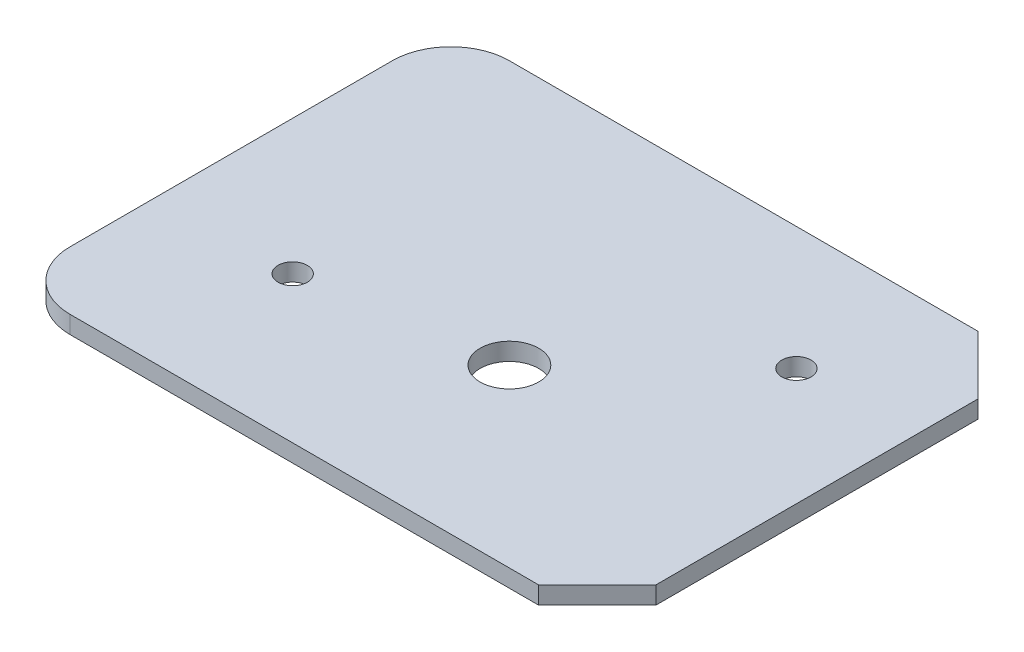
ISO-10303-21;
HEADER;
FILE_DESCRIPTION(('STEP AP214'),'2;1');
FILE_NAME('part.step','',(''),(''),'','','');
FILE_SCHEMA(('AUTOMOTIVE_DESIGN { 1 0 10303 214 1 1 1 1 }'));
ENDSEC;
DATA;
#1=APPLICATION_CONTEXT('core data for automotive mechanical design processes');
#2=APPLICATION_PROTOCOL_DEFINITION('international standard','automotive_design',2000,#1);
#3=PRODUCT_CONTEXT('',#1,'mechanical');
#4=PRODUCT('Part','Part','',(#3));
#5=PRODUCT_RELATED_PRODUCT_CATEGORY('part','',(#4));
#6=PRODUCT_DEFINITION_FORMATION('','',#4);
#7=PRODUCT_DEFINITION_CONTEXT('part definition',#1,'design');
#8=PRODUCT_DEFINITION('design','',#6,#7);
#9=PRODUCT_DEFINITION_SHAPE('','',#8);
#10=(LENGTH_UNIT() NAMED_UNIT(*) SI_UNIT(.MILLI.,.METRE.));
#11=(NAMED_UNIT(*) PLANE_ANGLE_UNIT() SI_UNIT($,.RADIAN.));
#12=(NAMED_UNIT(*) SI_UNIT($,.STERADIAN.) SOLID_ANGLE_UNIT());
#13=UNCERTAINTY_MEASURE_WITH_UNIT(LENGTH_MEASURE(1.E-05),#10,'distance_accuracy_value','');
#14=(GEOMETRIC_REPRESENTATION_CONTEXT(3) GLOBAL_UNCERTAINTY_ASSIGNED_CONTEXT((#13)) GLOBAL_UNIT_ASSIGNED_CONTEXT((#10,
#11,#12)) REPRESENTATION_CONTEXT('',''));
#15=CARTESIAN_POINT('',(0.,0.,0.));
#16=DIRECTION('',(0.,0.,1.));
#17=DIRECTION('',(1.,0.,0.));
#18=AXIS2_PLACEMENT_3D('',#15,#16,#17);
#19=CARTESIAN_POINT('',(10.,3.,-65.));
#20=DIRECTION('',(0.,-1.,0.));
#21=DIRECTION('',(0.,0.,-1.));
#22=AXIS2_PLACEMENT_3D('',#19,#20,#21);
#23=PLANE('',#22);
#24=CARTESIAN_POINT('',(55.,3.,-30.));
#25=DIRECTION('',(0.,1.,0.));
#26=DIRECTION('',(0.,0.,1.));
#27=AXIS2_PLACEMENT_3D('',#24,#25,#26);
#28=CIRCLE('',#27,5.);
#29=CARTESIAN_POINT('',(55.,3.,-25.));
#30=VERTEX_POINT('',#29);
#31=EDGE_CURVE('E229',#30,#30,#28,.T.);
#32=ORIENTED_EDGE('',*,*,#31,.F.);
#33=EDGE_LOOP('',(#32));
#34=FACE_BOUND('',#33,.T.);
#35=CARTESIAN_POINT('',(10.,3.,-65.));
#36=DIRECTION('',(0.,1.,0.));
#37=DIRECTION('',(0.,0.,-1.));
#38=AXIS2_PLACEMENT_3D('',#35,#36,#37);
#39=CIRCLE('',#38,10.);
#40=CARTESIAN_POINT('',(10.0000000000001,3.,-75.));
#41=VERTEX_POINT('',#40);
#42=CARTESIAN_POINT('',(0.,3.,-64.9999999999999));
#43=VERTEX_POINT('',#42);
#44=EDGE_CURVE('E134',#41,#43,#39,.T.);
#45=ORIENTED_EDGE('',*,*,#44,.T.);
#46=DIRECTION('',(0.,0.,1.));
#47=VECTOR('',#46,1.);
#48=CARTESIAN_POINT('',(0.,3.,-10.0000000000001));
#49=LINE('',#48,#47);
#50=CARTESIAN_POINT('',(0.,3.,-10.0000000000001));
#51=VERTEX_POINT('',#50);
#52=EDGE_CURVE('E111',#43,#51,#49,.T.);
#53=ORIENTED_EDGE('',*,*,#52,.T.);
#54=CARTESIAN_POINT('',(10.,3.,-10.));
#55=DIRECTION('',(0.,1.,0.));
#56=DIRECTION('',(0.,0.,-1.));
#57=AXIS2_PLACEMENT_3D('',#54,#55,#56);
#58=CIRCLE('',#57,10.);
#59=CARTESIAN_POINT('',(10.0000000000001,3.,0.));
#60=VERTEX_POINT('',#59);
#61=EDGE_CURVE('E137',#51,#60,#58,.T.);
#62=ORIENTED_EDGE('',*,*,#61,.T.);
#63=DIRECTION('',(1.,0.,0.));
#64=VECTOR('',#63,1.);
#65=CARTESIAN_POINT('',(10.0000000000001,3.,0.));
#66=LINE('',#65,#64);
#67=CARTESIAN_POINT('',(90.,3.,0.));
#68=VERTEX_POINT('',#67);
#69=EDGE_CURVE('E139',#60,#68,#66,.T.);
#70=ORIENTED_EDGE('',*,*,#69,.T.);
#71=DIRECTION('',(0.707106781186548,0.,-0.707106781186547));
#72=VECTOR('',#71,1.);
#73=CARTESIAN_POINT('',(100.,3.,-10.));
#74=LINE('',#73,#72);
#75=CARTESIAN_POINT('',(100.,3.,-10.));
#76=VERTEX_POINT('',#75);
#77=EDGE_CURVE('E141',#68,#76,#74,.T.);
#78=ORIENTED_EDGE('',*,*,#77,.T.);
#79=DIRECTION('',(0.,0.,-1.));
#80=VECTOR('',#79,1.);
#81=CARTESIAN_POINT('',(100.,3.,-10.));
#82=LINE('',#81,#80);
#83=CARTESIAN_POINT('',(100.,3.,-65.));
#84=VERTEX_POINT('',#83);
#85=EDGE_CURVE('E143',#76,#84,#82,.T.);
#86=ORIENTED_EDGE('',*,*,#85,.T.);
#87=DIRECTION('',(-0.707106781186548,0.,-0.707106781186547));
#88=VECTOR('',#87,1.);
#89=CARTESIAN_POINT('',(90.,3.,-75.));
#90=LINE('',#89,#88);
#91=CARTESIAN_POINT('',(90.,3.,-75.));
#92=VERTEX_POINT('',#91);
#93=EDGE_CURVE('E52',#84,#92,#90,.T.);
#94=ORIENTED_EDGE('',*,*,#93,.T.);
#95=DIRECTION('',(-1.,0.,0.));
#96=VECTOR('',#95,1.);
#97=CARTESIAN_POINT('',(10.0000000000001,3.,-75.));
#98=LINE('',#97,#96);
#99=EDGE_CURVE('E47',#92,#41,#98,.T.);
#100=ORIENTED_EDGE('',*,*,#99,.T.);
#101=EDGE_LOOP('',(#45,#53,#62,#70,#78,#86,#94,#100));
#102=FACE_BOUND('',#101,.T.);
#103=CARTESIAN_POINT('',(80.,3.,-54.));
#104=DIRECTION('',(0.,1.,0.));
#105=DIRECTION('',(0.,0.,1.));
#106=AXIS2_PLACEMENT_3D('',#103,#104,#105);
#107=CIRCLE('',#106,2.5);
#108=CARTESIAN_POINT('',(80.,3.,-51.5));
#109=VERTEX_POINT('',#108);
#110=EDGE_CURVE('E116',#109,#109,#107,.T.);
#111=ORIENTED_EDGE('',*,*,#110,.F.);
#112=EDGE_LOOP('',(#111));
#113=FACE_BOUND('',#112,.T.);
#114=CARTESIAN_POINT('',(23.,3.,-25.));
#115=DIRECTION('',(0.,1.,0.));
#116=DIRECTION('',(0.,0.,1.));
#117=AXIS2_PLACEMENT_3D('',#114,#115,#116);
#118=CIRCLE('',#117,2.5);
#119=CARTESIAN_POINT('',(23.,3.,-22.5));
#120=VERTEX_POINT('',#119);
#121=EDGE_CURVE('E218',#120,#120,#118,.T.);
#122=ORIENTED_EDGE('',*,*,#121,.F.);
#123=EDGE_LOOP('',(#122));
#124=FACE_BOUND('',#123,.T.);
#125=ADVANCED_FACE('F32',(#34,#102,#113,#124),#23,.F.);
#126=CARTESIAN_POINT('',(10.,0.,-65.));
#127=DIRECTION('',(0.,-1.,0.));
#128=DIRECTION('',(0.,0.,-1.));
#129=AXIS2_PLACEMENT_3D('',#126,#127,#128);
#130=PLANE('',#129);
#131=CARTESIAN_POINT('',(55.,0.,-30.));
#132=DIRECTION('',(0.,1.,0.));
#133=DIRECTION('',(0.,0.,1.));
#134=AXIS2_PLACEMENT_3D('',#131,#132,#133);
#135=CIRCLE('',#134,5.);
#136=CARTESIAN_POINT('',(55.,0.,-25.));
#137=VERTEX_POINT('',#136);
#138=EDGE_CURVE('E224',#137,#137,#135,.T.);
#139=ORIENTED_EDGE('',*,*,#138,.T.);
#140=EDGE_LOOP('',(#139));
#141=FACE_BOUND('',#140,.T.);
#142=CARTESIAN_POINT('',(10.,0.,-65.));
#143=DIRECTION('',(0.,1.,0.));
#144=DIRECTION('',(0.,0.,-1.));
#145=AXIS2_PLACEMENT_3D('',#142,#143,#144);
#146=CIRCLE('',#145,10.);
#147=CARTESIAN_POINT('',(10.0000000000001,0.,-75.));
#148=VERTEX_POINT('',#147);
#149=CARTESIAN_POINT('',(0.,0.,-64.9999999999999));
#150=VERTEX_POINT('',#149);
#151=EDGE_CURVE('E102',#148,#150,#146,.T.);
#152=ORIENTED_EDGE('',*,*,#151,.F.);
#153=DIRECTION('',(-1.,0.,0.));
#154=VECTOR('',#153,1.);
#155=CARTESIAN_POINT('',(10.0000000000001,0.,-75.));
#156=LINE('',#155,#154);
#157=CARTESIAN_POINT('',(90.,0.,-75.));
#158=VERTEX_POINT('',#157);
#159=EDGE_CURVE('E132',#158,#148,#156,.T.);
#160=ORIENTED_EDGE('',*,*,#159,.F.);
#161=DIRECTION('',(-0.707106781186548,0.,-0.707106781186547));
#162=VECTOR('',#161,1.);
#163=CARTESIAN_POINT('',(90.,0.,-75.));
#164=LINE('',#163,#162);
#165=CARTESIAN_POINT('',(100.,0.,-65.));
#166=VERTEX_POINT('',#165);
#167=EDGE_CURVE('E130',#166,#158,#164,.T.);
#168=ORIENTED_EDGE('',*,*,#167,.F.);
#169=DIRECTION('',(0.,0.,-1.));
#170=VECTOR('',#169,1.);
#171=CARTESIAN_POINT('',(100.,0.,-10.));
#172=LINE('',#171,#170);
#173=CARTESIAN_POINT('',(100.,0.,-10.));
#174=VERTEX_POINT('',#173);
#175=EDGE_CURVE('E128',#174,#166,#172,.T.);
#176=ORIENTED_EDGE('',*,*,#175,.F.);
#177=DIRECTION('',(0.707106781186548,0.,-0.707106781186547));
#178=VECTOR('',#177,1.);
#179=CARTESIAN_POINT('',(100.,0.,-10.));
#180=LINE('',#179,#178);
#181=CARTESIAN_POINT('',(90.,0.,0.));
#182=VERTEX_POINT('',#181);
#183=EDGE_CURVE('E126',#182,#174,#180,.T.);
#184=ORIENTED_EDGE('',*,*,#183,.F.);
#185=DIRECTION('',(1.,0.,0.));
#186=VECTOR('',#185,1.);
#187=CARTESIAN_POINT('',(10.0000000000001,0.,0.));
#188=LINE('',#187,#186);
#189=CARTESIAN_POINT('',(10.0000000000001,0.,0.));
#190=VERTEX_POINT('',#189);
#191=EDGE_CURVE('E124',#190,#182,#188,.T.);
#192=ORIENTED_EDGE('',*,*,#191,.F.);
#193=CARTESIAN_POINT('',(10.,0.,-10.));
#194=DIRECTION('',(0.,1.,0.));
#195=DIRECTION('',(0.,0.,-1.));
#196=AXIS2_PLACEMENT_3D('',#193,#194,#195);
#197=CIRCLE('',#196,10.);
#198=CARTESIAN_POINT('',(0.,0.,-10.0000000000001));
#199=VERTEX_POINT('',#198);
#200=EDGE_CURVE('E104',#199,#190,#197,.T.);
#201=ORIENTED_EDGE('',*,*,#200,.F.);
#202=DIRECTION('',(0.,0.,1.));
#203=VECTOR('',#202,1.);
#204=CARTESIAN_POINT('',(0.,0.,-10.0000000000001));
#205=LINE('',#204,#203);
#206=EDGE_CURVE('E97',#150,#199,#205,.T.);
#207=ORIENTED_EDGE('',*,*,#206,.F.);
#208=EDGE_LOOP('',(#152,#160,#168,#176,#184,#192,#201,#207));
#209=FACE_BOUND('',#208,.T.);
#210=CARTESIAN_POINT('',(80.,0.,-54.));
#211=DIRECTION('',(0.,1.,0.));
#212=DIRECTION('',(0.,0.,1.));
#213=AXIS2_PLACEMENT_3D('',#210,#211,#212);
#214=CIRCLE('',#213,2.5);
#215=CARTESIAN_POINT('',(80.,0.,-51.5));
#216=VERTEX_POINT('',#215);
#217=EDGE_CURVE('E119',#216,#216,#214,.T.);
#218=ORIENTED_EDGE('',*,*,#217,.T.);
#219=EDGE_LOOP('',(#218));
#220=FACE_BOUND('',#219,.T.);
#221=CARTESIAN_POINT('',(23.,0.,-25.));
#222=DIRECTION('',(0.,1.,0.));
#223=DIRECTION('',(0.,0.,1.));
#224=AXIS2_PLACEMENT_3D('',#221,#222,#223);
#225=CIRCLE('',#224,2.5);
#226=CARTESIAN_POINT('',(23.,0.,-22.5));
#227=VERTEX_POINT('',#226);
#228=EDGE_CURVE('E221',#227,#227,#225,.T.);
#229=ORIENTED_EDGE('',*,*,#228,.T.);
#230=EDGE_LOOP('',(#229));
#231=FACE_BOUND('',#230,.T.);
#232=ADVANCED_FACE('F98',(#141,#209,#220,#231),#130,.T.);
#233=CARTESIAN_POINT('',(10.,3.,-65.));
#234=DIRECTION('',(0.,-1.,0.));
#235=DIRECTION('',(0.,0.,-1.));
#236=AXIS2_PLACEMENT_3D('',#233,#234,#235);
#237=CYLINDRICAL_SURFACE('',#236,10.);
#238=ORIENTED_EDGE('',*,*,#151,.T.);
#239=DIRECTION('',(0.,-1.,0.));
#240=VECTOR('',#239,1.);
#241=CARTESIAN_POINT('',(0.,3.,-64.9999999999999));
#242=LINE('',#241,#240);
#243=EDGE_CURVE('E11',#43,#150,#242,.T.);
#244=ORIENTED_EDGE('',*,*,#243,.F.);
#245=ORIENTED_EDGE('',*,*,#44,.F.);
#246=DIRECTION('',(0.,-1.,0.));
#247=VECTOR('',#246,1.);
#248=CARTESIAN_POINT('',(10.0000000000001,3.,-75.));
#249=LINE('',#248,#247);
#250=EDGE_CURVE('E115',#41,#148,#249,.T.);
#251=ORIENTED_EDGE('',*,*,#250,.T.);
#252=EDGE_LOOP('',(#238,#244,#245,#251));
#253=FACE_BOUND('',#252,.T.);
#254=ADVANCED_FACE('F34',(#253),#237,.T.);
#255=CARTESIAN_POINT('',(0.,3.,-10.0000000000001));
#256=DIRECTION('',(1.,0.,0.));
#257=DIRECTION('',(0.,0.,-1.));
#258=AXIS2_PLACEMENT_3D('',#255,#256,#257);
#259=PLANE('',#258);
#260=ORIENTED_EDGE('',*,*,#206,.T.);
#261=DIRECTION('',(0.,-1.,0.));
#262=VECTOR('',#261,1.);
#263=CARTESIAN_POINT('',(0.,3.,-10.0000000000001));
#264=LINE('',#263,#262);
#265=EDGE_CURVE('E40',#51,#199,#264,.T.);
#266=ORIENTED_EDGE('',*,*,#265,.F.);
#267=ORIENTED_EDGE('',*,*,#52,.F.);
#268=ORIENTED_EDGE('',*,*,#243,.T.);
#269=EDGE_LOOP('',(#260,#266,#267,#268));
#270=FACE_BOUND('',#269,.T.);
#271=ADVANCED_FACE('F110',(#270),#259,.F.);
#272=CARTESIAN_POINT('',(10.,3.,-10.));
#273=DIRECTION('',(0.,-1.,0.));
#274=DIRECTION('',(0.,0.,-1.));
#275=AXIS2_PLACEMENT_3D('',#272,#273,#274);
#276=CYLINDRICAL_SURFACE('',#275,10.);
#277=ORIENTED_EDGE('',*,*,#200,.T.);
#278=DIRECTION('',(0.,-1.,0.));
#279=VECTOR('',#278,1.);
#280=CARTESIAN_POINT('',(10.0000000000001,3.,0.));
#281=LINE('',#280,#279);
#282=EDGE_CURVE('E160',#60,#190,#281,.T.);
#283=ORIENTED_EDGE('',*,*,#282,.F.);
#284=ORIENTED_EDGE('',*,*,#61,.F.);
#285=ORIENTED_EDGE('',*,*,#265,.T.);
#286=EDGE_LOOP('',(#277,#283,#284,#285));
#287=FACE_BOUND('',#286,.T.);
#288=ADVANCED_FACE('F164',(#287),#276,.T.);
#289=CARTESIAN_POINT('',(10.0000000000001,3.,0.));
#290=DIRECTION('',(0.,0.,-1.));
#291=DIRECTION('',(-1.,0.,0.));
#292=AXIS2_PLACEMENT_3D('',#289,#290,#291);
#293=PLANE('',#292);
#294=ORIENTED_EDGE('',*,*,#191,.T.);
#295=DIRECTION('',(0.,-1.,0.));
#296=VECTOR('',#295,1.);
#297=CARTESIAN_POINT('',(90.,3.,0.));
#298=LINE('',#297,#296);
#299=EDGE_CURVE('E157',#68,#182,#298,.T.);
#300=ORIENTED_EDGE('',*,*,#299,.F.);
#301=ORIENTED_EDGE('',*,*,#69,.F.);
#302=ORIENTED_EDGE('',*,*,#282,.T.);
#303=EDGE_LOOP('',(#294,#300,#301,#302));
#304=FACE_BOUND('',#303,.T.);
#305=ADVANCED_FACE('F172',(#304),#293,.F.);
#306=CARTESIAN_POINT('',(100.,3.,-10.));
#307=DIRECTION('',(-0.707106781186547,0.,-0.707106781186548));
#308=DIRECTION('',(-0.707106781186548,0.,0.707106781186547));
#309=AXIS2_PLACEMENT_3D('',#306,#307,#308);
#310=PLANE('',#309);
#311=ORIENTED_EDGE('',*,*,#183,.T.);
#312=DIRECTION('',(0.,-1.,0.));
#313=VECTOR('',#312,1.);
#314=CARTESIAN_POINT('',(100.,3.,-10.));
#315=LINE('',#314,#313);
#316=EDGE_CURVE('E154',#76,#174,#315,.T.);
#317=ORIENTED_EDGE('',*,*,#316,.F.);
#318=ORIENTED_EDGE('',*,*,#77,.F.);
#319=ORIENTED_EDGE('',*,*,#299,.T.);
#320=EDGE_LOOP('',(#311,#317,#318,#319));
#321=FACE_BOUND('',#320,.T.);
#322=ADVANCED_FACE('F175',(#321),#310,.F.);
#323=CARTESIAN_POINT('',(100.,3.,-10.));
#324=DIRECTION('',(-1.,0.,0.));
#325=DIRECTION('',(0.,0.,1.));
#326=AXIS2_PLACEMENT_3D('',#323,#324,#325);
#327=PLANE('',#326);
#328=ORIENTED_EDGE('',*,*,#175,.T.);
#329=DIRECTION('',(0.,-1.,0.));
#330=VECTOR('',#329,1.);
#331=CARTESIAN_POINT('',(100.,3.,-65.));
#332=LINE('',#331,#330);
#333=EDGE_CURVE('E151',#84,#166,#332,.T.);
#334=ORIENTED_EDGE('',*,*,#333,.F.);
#335=ORIENTED_EDGE('',*,*,#85,.F.);
#336=ORIENTED_EDGE('',*,*,#316,.T.);
#337=EDGE_LOOP('',(#328,#334,#335,#336));
#338=FACE_BOUND('',#337,.T.);
#339=ADVANCED_FACE('F180',(#338),#327,.F.);
#340=CARTESIAN_POINT('',(90.,3.,-75.));
#341=DIRECTION('',(-0.707106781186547,0.,0.707106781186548));
#342=DIRECTION('',(0.707106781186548,0.,0.707106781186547));
#343=AXIS2_PLACEMENT_3D('',#340,#341,#342);
#344=PLANE('',#343);
#345=ORIENTED_EDGE('',*,*,#167,.T.);
#346=DIRECTION('',(0.,-1.,0.));
#347=VECTOR('',#346,1.);
#348=CARTESIAN_POINT('',(90.,3.,-75.));
#349=LINE('',#348,#347);
#350=EDGE_CURVE('E148',#92,#158,#349,.T.);
#351=ORIENTED_EDGE('',*,*,#350,.F.);
#352=ORIENTED_EDGE('',*,*,#93,.F.);
#353=ORIENTED_EDGE('',*,*,#333,.T.);
#354=EDGE_LOOP('',(#345,#351,#352,#353));
#355=FACE_BOUND('',#354,.T.);
#356=ADVANCED_FACE('F183',(#355),#344,.F.);
#357=CARTESIAN_POINT('',(10.0000000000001,3.,-75.));
#358=DIRECTION('',(0.,0.,1.));
#359=DIRECTION('',(1.,0.,0.));
#360=AXIS2_PLACEMENT_3D('',#357,#358,#359);
#361=PLANE('',#360);
#362=ORIENTED_EDGE('',*,*,#159,.T.);
#363=ORIENTED_EDGE('',*,*,#250,.F.);
#364=ORIENTED_EDGE('',*,*,#99,.F.);
#365=ORIENTED_EDGE('',*,*,#350,.T.);
#366=EDGE_LOOP('',(#362,#363,#364,#365));
#367=FACE_BOUND('',#366,.T.);
#368=ADVANCED_FACE('F185',(#367),#361,.F.);
#369=CARTESIAN_POINT('',(80.,3.,-54.));
#370=DIRECTION('',(0.,-1.,0.));
#371=DIRECTION('',(0.,0.,-1.));
#372=AXIS2_PLACEMENT_3D('',#369,#370,#371);
#373=CYLINDRICAL_SURFACE('',#372,2.5);
#374=ORIENTED_EDGE('',*,*,#110,.T.);
#375=EDGE_LOOP('',(#374));
#376=FACE_BOUND('',#375,.T.);
#377=ORIENTED_EDGE('',*,*,#217,.F.);
#378=EDGE_LOOP('',(#377));
#379=FACE_BOUND('',#378,.T.);
#380=ADVANCED_FACE('F187',(#376,#379),#373,.F.);
#381=CARTESIAN_POINT('',(55.,3.,-30.));
#382=DIRECTION('',(0.,-1.,0.));
#383=DIRECTION('',(0.,0.,-1.));
#384=AXIS2_PLACEMENT_3D('',#381,#382,#383);
#385=CYLINDRICAL_SURFACE('',#384,5.);
#386=ORIENTED_EDGE('',*,*,#31,.T.);
#387=EDGE_LOOP('',(#386));
#388=FACE_BOUND('',#387,.T.);
#389=ORIENTED_EDGE('',*,*,#138,.F.);
#390=EDGE_LOOP('',(#389));
#391=FACE_BOUND('',#390,.T.);
#392=ADVANCED_FACE('F193',(#388,#391),#385,.F.);
#393=CARTESIAN_POINT('',(23.,3.,-25.));
#394=DIRECTION('',(0.,-1.,0.));
#395=DIRECTION('',(0.,0.,-1.));
#396=AXIS2_PLACEMENT_3D('',#393,#394,#395);
#397=CYLINDRICAL_SURFACE('',#396,2.5);
#398=ORIENTED_EDGE('',*,*,#121,.T.);
#399=EDGE_LOOP('',(#398));
#400=FACE_BOUND('',#399,.T.);
#401=ORIENTED_EDGE('',*,*,#228,.F.);
#402=EDGE_LOOP('',(#401));
#403=FACE_BOUND('',#402,.T.);
#404=ADVANCED_FACE('F209',(#400,#403),#397,.F.);
#405=CLOSED_SHELL('',(#125,#232,#254,#271,#288,#305,#322,#339,#356,#368,#380,#392,#404));
#406=MANIFOLD_SOLID_BREP('B2',#405);
#407=ADVANCED_BREP_SHAPE_REPRESENTATION('',(#18,#406),#14);
#408=SHAPE_DEFINITION_REPRESENTATION(#9,#407);
ENDSEC;
END-ISO-10303-21;
